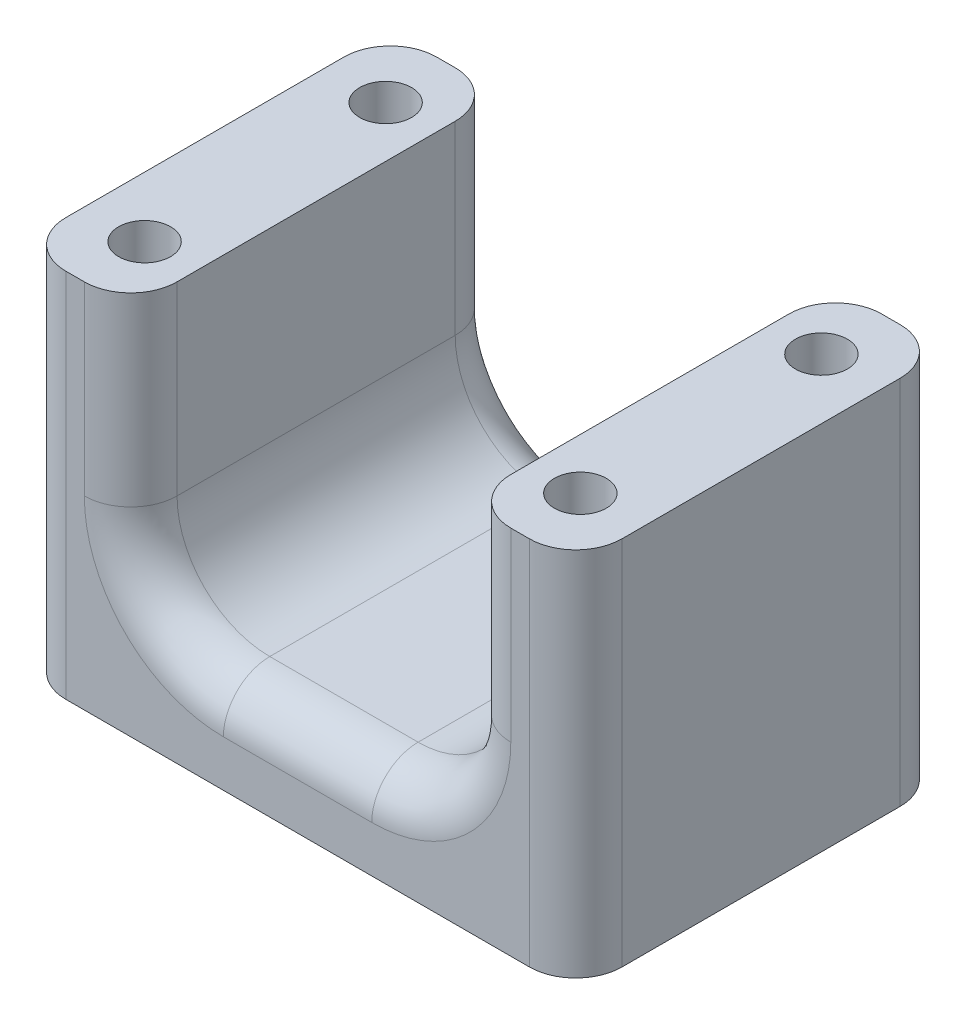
from build123d import *

# Parameters (mm, degrees)
SKETCH_1_W          = 60
SKETCH_1_H          = 40
EXTRUDE_1_DEPTH     = 40
SKETCH_2_W          = 36
SKETCH_2_H          = 40
CUT_EXTRUDE_1_DEPTH = 30
SKETCH_3_R          = 2.8
CUT_EXTRUDE_2_DEPTH = 83.462112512
FILLET_1_R          = 10
FILLET_2_R          = 5


with BuildPart() as part:
    # Sketch 1 → Extrude 1 (new body)
    with BuildSketch(Plane(origin=(0, 0, 0), x_dir=(1, 0, 0), z_dir=(0, 1, 0))):
        with Locations((30, 20)):
            Rectangle(SKETCH_1_W, SKETCH_1_H)
    extrude(amount=EXTRUDE_1_DEPTH)

    # Sketch 2 → Cut-Extrude 1 (cut)
    with BuildSketch(Plane(origin=(0, 40, 0), x_dir=(1, 0, 0), z_dir=(0, 1, 0))):
        with Locations((30, 20)):
            Rectangle(SKETCH_2_W, SKETCH_2_H)
    extrude(amount=-CUT_EXTRUDE_1_DEPTH, mode=Mode.SUBTRACT)

    # Sketch 3 → Cut-Extrude 2 (cut, through all)
    with BuildSketch(Plane(origin=(0, 40, 0), x_dir=(1, 0, 0), z_dir=(0, 1, 0))):
        with Locations(Location((6.5, 33, 0), (0, 0, 270))):
            Circle(SKETCH_3_R)
        with Locations(Location((6.5, 7, 0), (0, 0, 270))):
            Circle(SKETCH_3_R)
        with Locations(Location((53.5, 33, 0), (0, 0, 270))):
            Circle(SKETCH_3_R)
        with Locations(Location((53.5, 7, 0), (0, 0, 270))):
            Circle(SKETCH_3_R)
    extrude(amount=-CUT_EXTRUDE_2_DEPTH, mode=Mode.SUBTRACT)

    # Fillet 1
    fillet_1_edges = [part.edges().sort_by_distance(p)[0] for p in [
        (12, 10, -20),
        (48, 10, -20),
    ]]
    fillet(fillet_1_edges, radius=FILLET_1_R)

    # Fillet 2
    fillet_2_edges = [part.edges().sort_by_distance(p)[0] for p in [
        (30, 10, 0),
        (30, 10, -40),
        (48, 30, -40),
        (48, 30, 0),
        (12, 30, 0),
        (12, 30, -40),
        (45.071067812, 12.928932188, -40),
        (45.071067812, 12.928932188, 0),
        (14.928932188, 12.928932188, 0),
        (14.928932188, 12.928932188, -40),
        (0, 20, -40),
        (60, 20, -40),
        (60, 20, 0),
        (0, 20, 0),
    ]]
    fillet(fillet_2_edges, radius=FILLET_2_R)


solid = part.part
